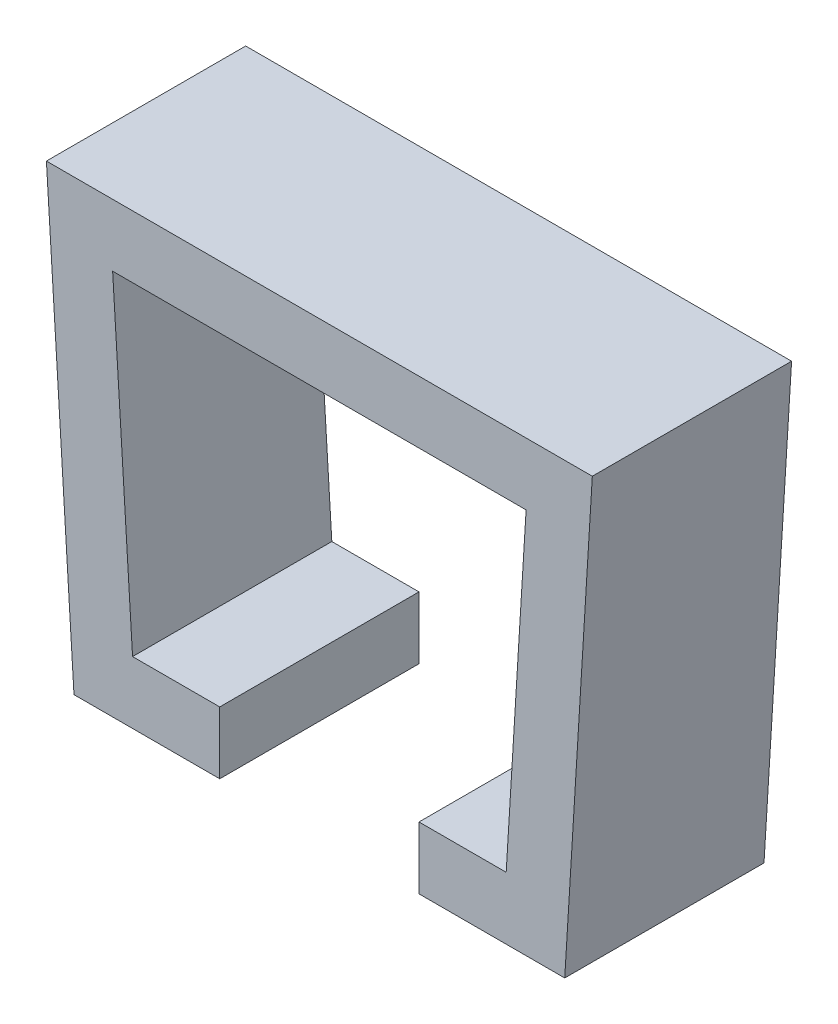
from build123d import *

# Parameters (mm, degrees)
BOSS_EXTRU_1_DEPTH = 4


with BuildPart() as part:
    # Esquisse1 → Boss.-Extru.1 (new body)
    with BuildSketch(Plane.XY):
        Polygon((-3.75, 0), (-4.15, 6.5), (4.15, 6.5), (3.75, 0), (2, 0), (2, -1.25), (4.92544155, -1.25), (5.479287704, 7.75), (-5.479287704, 7.75), (-4.92544155, -1.25), (-2, -1.25), (-2, 0), align=None)
    extrude(amount=BOSS_EXTRU_1_DEPTH)


solid = part.part
